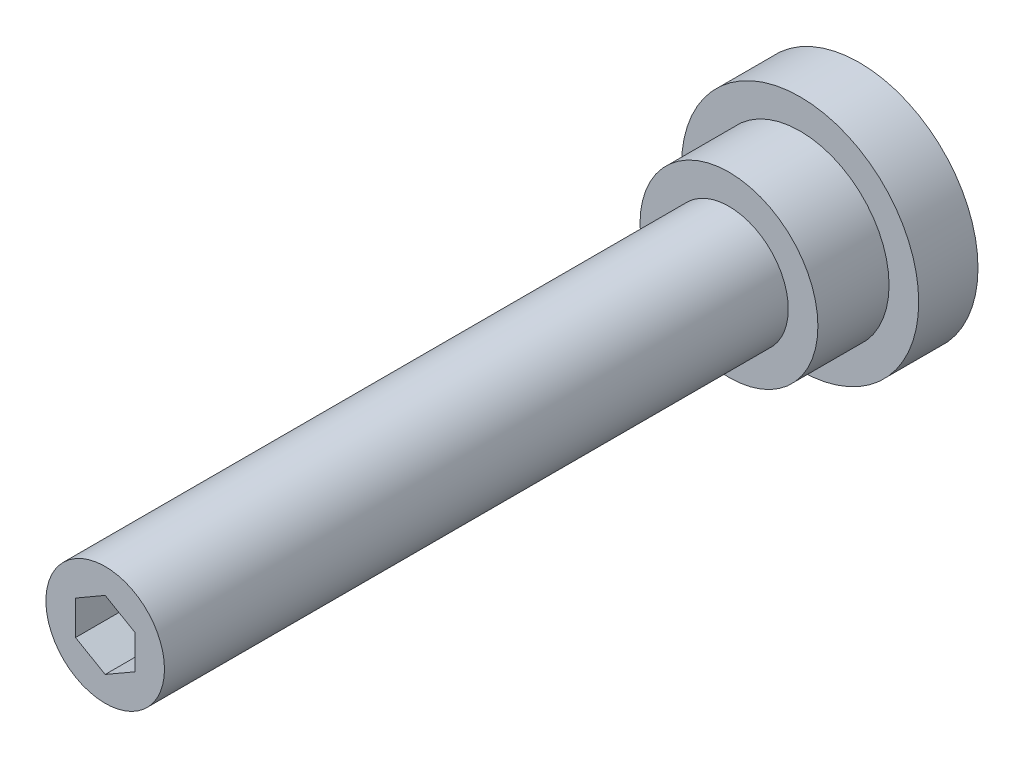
ISO-10303-21;
HEADER;
FILE_DESCRIPTION(('STEP AP214'),'2;1');
FILE_NAME('part.step','',(''),(''),'','','');
FILE_SCHEMA(('AUTOMOTIVE_DESIGN { 1 0 10303 214 1 1 1 1 }'));
ENDSEC;
DATA;
#1=APPLICATION_CONTEXT('core data for automotive mechanical design processes');
#2=APPLICATION_PROTOCOL_DEFINITION('international standard','automotive_design',2000,#1);
#3=PRODUCT_CONTEXT('',#1,'mechanical');
#4=PRODUCT('Part','Part','',(#3));
#5=PRODUCT_RELATED_PRODUCT_CATEGORY('part','',(#4));
#6=PRODUCT_DEFINITION_FORMATION('','',#4);
#7=PRODUCT_DEFINITION_CONTEXT('part definition',#1,'design');
#8=PRODUCT_DEFINITION('design','',#6,#7);
#9=PRODUCT_DEFINITION_SHAPE('','',#8);
#10=(LENGTH_UNIT() NAMED_UNIT(*) SI_UNIT(.MILLI.,.METRE.));
#11=(NAMED_UNIT(*) PLANE_ANGLE_UNIT() SI_UNIT($,.RADIAN.));
#12=(NAMED_UNIT(*) SI_UNIT($,.STERADIAN.) SOLID_ANGLE_UNIT());
#13=UNCERTAINTY_MEASURE_WITH_UNIT(LENGTH_MEASURE(1.E-05),#10,'distance_accuracy_value','');
#14=(GEOMETRIC_REPRESENTATION_CONTEXT(3) GLOBAL_UNCERTAINTY_ASSIGNED_CONTEXT((#13)) GLOBAL_UNIT_ASSIGNED_CONTEXT((#10,
#11,#12)) REPRESENTATION_CONTEXT('',''));
#15=CARTESIAN_POINT('',(0.,0.,0.));
#16=DIRECTION('',(0.,0.,1.));
#17=DIRECTION('',(1.,0.,0.));
#18=AXIS2_PLACEMENT_3D('',#15,#16,#17);
#19=CARTESIAN_POINT('',(0.,0.,63.6));
#20=DIRECTION('',(0.,0.,1.));
#21=DIRECTION('',(1.,0.,0.));
#22=AXIS2_PLACEMENT_3D('',#19,#20,#21);
#23=PLANE('',#22);
#24=DIRECTION('',(-0.866025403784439,0.5,0.));
#25=VECTOR('',#24,1.);
#26=CARTESIAN_POINT('',(2.5,1.44337567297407,63.6));
#27=LINE('',#26,#25);
#28=CARTESIAN_POINT('',(2.5,1.44337567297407,63.6));
#29=VERTEX_POINT('',#28);
#30=CARTESIAN_POINT('',(0.,2.88675134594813,63.6));
#31=VERTEX_POINT('',#30);
#32=EDGE_CURVE('E132',#29,#31,#27,.T.);
#33=ORIENTED_EDGE('',*,*,#32,.F.);
#34=DIRECTION('',(0.,1.,0.));
#35=VECTOR('',#34,1.);
#36=CARTESIAN_POINT('',(2.5,-1.44337567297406,63.6));
#37=LINE('',#36,#35);
#38=CARTESIAN_POINT('',(2.5,-1.44337567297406,63.6));
#39=VERTEX_POINT('',#38);
#40=EDGE_CURVE('E81',#39,#29,#37,.T.);
#41=ORIENTED_EDGE('',*,*,#40,.F.);
#42=DIRECTION('',(0.866025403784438,0.5,0.));
#43=VECTOR('',#42,1.);
#44=CARTESIAN_POINT('',(0.,-2.88675134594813,63.6));
#45=LINE('',#44,#43);
#46=CARTESIAN_POINT('',(0.,-2.88675134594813,63.6));
#47=VERTEX_POINT('',#46);
#48=EDGE_CURVE('E148',#47,#39,#45,.T.);
#49=ORIENTED_EDGE('',*,*,#48,.F.);
#50=DIRECTION('',(0.866025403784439,-0.5,0.));
#51=VECTOR('',#50,1.);
#52=CARTESIAN_POINT('',(-2.5,-1.44337567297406,63.6));
#53=LINE('',#52,#51);
#54=CARTESIAN_POINT('',(-2.5,-1.44337567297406,63.6));
#55=VERTEX_POINT('',#54);
#56=EDGE_CURVE('E146',#55,#47,#53,.T.);
#57=ORIENTED_EDGE('',*,*,#56,.F.);
#58=DIRECTION('',(0.,-1.,0.));
#59=VECTOR('',#58,1.);
#60=CARTESIAN_POINT('',(-2.5,1.44337567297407,63.6));
#61=LINE('',#60,#59);
#62=CARTESIAN_POINT('',(-2.5,1.44337567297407,63.6));
#63=VERTEX_POINT('',#62);
#64=EDGE_CURVE('E138',#63,#55,#61,.T.);
#65=ORIENTED_EDGE('',*,*,#64,.F.);
#66=DIRECTION('',(-0.866025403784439,-0.5,0.));
#67=VECTOR('',#66,1.);
#68=CARTESIAN_POINT('',(0.,2.88675134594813,63.6));
#69=LINE('',#68,#67);
#70=EDGE_CURVE('E136',#31,#63,#69,.T.);
#71=ORIENTED_EDGE('',*,*,#70,.F.);
#72=EDGE_LOOP('',(#33,#41,#49,#57,#65,#71));
#73=FACE_BOUND('',#72,.T.);
#74=CARTESIAN_POINT('',(0.,0.,63.6));
#75=DIRECTION('',(0.,0.,1.));
#76=DIRECTION('',(1.,0.,0.));
#77=AXIS2_PLACEMENT_3D('',#74,#75,#76);
#78=CIRCLE('',#77,5.);
#79=CARTESIAN_POINT('',(5.,0.,63.6));
#80=VERTEX_POINT('',#79);
#81=EDGE_CURVE('E9',#80,#80,#78,.T.);
#82=ORIENTED_EDGE('',*,*,#81,.T.);
#83=EDGE_LOOP('',(#82));
#84=FACE_BOUND('',#83,.T.);
#85=ADVANCED_FACE('F14',(#73,#84),#23,.T.);
#86=CARTESIAN_POINT('',(0.,0.,30.));
#87=DIRECTION('',(0.,0.,1.));
#88=DIRECTION('',(1.,0.,0.));
#89=AXIS2_PLACEMENT_3D('',#86,#87,#88);
#90=CYLINDRICAL_SURFACE('',#89,5.);
#91=CARTESIAN_POINT('',(0.,0.,11.));
#92=DIRECTION('',(0.,0.,1.));
#93=DIRECTION('',(1.,0.,0.));
#94=AXIS2_PLACEMENT_3D('',#91,#92,#93);
#95=CIRCLE('',#94,5.);
#96=CARTESIAN_POINT('',(5.,0.,11.));
#97=VERTEX_POINT('',#96);
#98=EDGE_CURVE('E21',#97,#97,#95,.T.);
#99=ORIENTED_EDGE('',*,*,#98,.T.);
#100=EDGE_LOOP('',(#99));
#101=FACE_BOUND('',#100,.T.);
#102=ORIENTED_EDGE('',*,*,#81,.F.);
#103=EDGE_LOOP('',(#102));
#104=FACE_BOUND('',#103,.T.);
#105=ADVANCED_FACE('F110',(#101,#104),#90,.T.);
#106=CARTESIAN_POINT('',(-5.,0.,11.));
#107=DIRECTION('',(0.,0.,1.));
#108=DIRECTION('',(1.,0.,0.));
#109=AXIS2_PLACEMENT_3D('',#106,#107,#108);
#110=PLANE('',#109);
#111=CARTESIAN_POINT('',(0.,0.,11.));
#112=DIRECTION('',(0.,0.,1.));
#113=DIRECTION('',(1.,0.,0.));
#114=AXIS2_PLACEMENT_3D('',#111,#112,#113);
#115=CIRCLE('',#114,7.5);
#116=CARTESIAN_POINT('',(7.5,0.,11.));
#117=VERTEX_POINT('',#116);
#118=EDGE_CURVE('E105',#117,#117,#115,.T.);
#119=ORIENTED_EDGE('',*,*,#118,.T.);
#120=EDGE_LOOP('',(#119));
#121=FACE_BOUND('',#120,.T.);
#122=ORIENTED_EDGE('',*,*,#98,.F.);
#123=EDGE_LOOP('',(#122));
#124=FACE_BOUND('',#123,.T.);
#125=ADVANCED_FACE('F113',(#121,#124),#110,.T.);
#126=CARTESIAN_POINT('',(0.,0.,30.));
#127=DIRECTION('',(0.,0.,1.));
#128=DIRECTION('',(1.,0.,0.));
#129=AXIS2_PLACEMENT_3D('',#126,#127,#128);
#130=CYLINDRICAL_SURFACE('',#129,7.5);
#131=CARTESIAN_POINT('',(0.,0.,5.));
#132=DIRECTION('',(0.,0.,1.));
#133=DIRECTION('',(1.,0.,0.));
#134=AXIS2_PLACEMENT_3D('',#131,#132,#133);
#135=CIRCLE('',#134,7.5);
#136=CARTESIAN_POINT('',(7.5,0.,5.));
#137=VERTEX_POINT('',#136);
#138=EDGE_CURVE('E102',#137,#137,#135,.T.);
#139=ORIENTED_EDGE('',*,*,#138,.T.);
#140=EDGE_LOOP('',(#139));
#141=FACE_BOUND('',#140,.T.);
#142=ORIENTED_EDGE('',*,*,#118,.F.);
#143=EDGE_LOOP('',(#142));
#144=FACE_BOUND('',#143,.T.);
#145=ADVANCED_FACE('F115',(#141,#144),#130,.T.);
#146=CARTESIAN_POINT('',(-7.5,0.,5.));
#147=DIRECTION('',(0.,0.,1.));
#148=DIRECTION('',(1.,0.,0.));
#149=AXIS2_PLACEMENT_3D('',#146,#147,#148);
#150=PLANE('',#149);
#151=CARTESIAN_POINT('',(0.,0.,5.));
#152=DIRECTION('',(0.,0.,1.));
#153=DIRECTION('',(1.,0.,0.));
#154=AXIS2_PLACEMENT_3D('',#151,#152,#153);
#155=CIRCLE('',#154,10.);
#156=CARTESIAN_POINT('',(10.,0.,5.));
#157=VERTEX_POINT('',#156);
#158=EDGE_CURVE('E87',#157,#157,#155,.T.);
#159=ORIENTED_EDGE('',*,*,#158,.T.);
#160=EDGE_LOOP('',(#159));
#161=FACE_BOUND('',#160,.T.);
#162=ORIENTED_EDGE('',*,*,#138,.F.);
#163=EDGE_LOOP('',(#162));
#164=FACE_BOUND('',#163,.T.);
#165=ADVANCED_FACE('F123',(#161,#164),#150,.T.);
#166=CARTESIAN_POINT('',(0.,0.,30.));
#167=DIRECTION('',(0.,0.,1.));
#168=DIRECTION('',(1.,0.,0.));
#169=AXIS2_PLACEMENT_3D('',#166,#167,#168);
#170=CYLINDRICAL_SURFACE('',#169,10.);
#171=CARTESIAN_POINT('',(0.,0.,0.));
#172=DIRECTION('',(0.,0.,1.));
#173=DIRECTION('',(1.,0.,0.));
#174=AXIS2_PLACEMENT_3D('',#171,#172,#173);
#175=CIRCLE('',#174,10.);
#176=CARTESIAN_POINT('',(10.,0.,0.));
#177=VERTEX_POINT('',#176);
#178=EDGE_CURVE('E83',#177,#177,#175,.T.);
#179=ORIENTED_EDGE('',*,*,#178,.T.);
#180=EDGE_LOOP('',(#179));
#181=FACE_BOUND('',#180,.T.);
#182=ORIENTED_EDGE('',*,*,#158,.F.);
#183=EDGE_LOOP('',(#182));
#184=FACE_BOUND('',#183,.T.);
#185=ADVANCED_FACE('F179',(#181,#184),#170,.T.);
#186=CARTESIAN_POINT('',(-10.,0.,0.));
#187=DIRECTION('',(0.,0.,-1.));
#188=DIRECTION('',(-1.,0.,0.));
#189=AXIS2_PLACEMENT_3D('',#186,#187,#188);
#190=PLANE('',#189);
#191=ORIENTED_EDGE('',*,*,#178,.F.);
#192=EDGE_LOOP('',(#191));
#193=FACE_BOUND('',#192,.T.);
#194=ADVANCED_FACE('F176',(#193),#190,.T.);
#195=CARTESIAN_POINT('',(2.5,1.44337567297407,58.6));
#196=DIRECTION('',(0.5,0.866025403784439,0.));
#197=DIRECTION('',(-0.866025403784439,0.5,0.));
#198=AXIS2_PLACEMENT_3D('',#195,#196,#197);
#199=PLANE('',#198);
#200=DIRECTION('',(0.,0.,1.));
#201=VECTOR('',#200,1.);
#202=CARTESIAN_POINT('',(0.,2.88675134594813,58.6));
#203=LINE('',#202,#201);
#204=CARTESIAN_POINT('',(0.,2.88675134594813,59.6));
#205=VERTEX_POINT('',#204);
#206=EDGE_CURVE('E35',#205,#31,#203,.T.);
#207=ORIENTED_EDGE('',*,*,#206,.F.);
#208=DIRECTION('',(-0.866025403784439,0.5,0.));
#209=VECTOR('',#208,1.);
#210=CARTESIAN_POINT('',(2.5,1.44337567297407,59.6));
#211=LINE('',#210,#209);
#212=CARTESIAN_POINT('',(2.5,1.44337567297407,59.6));
#213=VERTEX_POINT('',#212);
#214=EDGE_CURVE('E28',#213,#205,#211,.T.);
#215=ORIENTED_EDGE('',*,*,#214,.F.);
#216=DIRECTION('',(0.,0.,1.));
#217=VECTOR('',#216,1.);
#218=CARTESIAN_POINT('',(2.5,1.44337567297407,58.6));
#219=LINE('',#218,#217);
#220=EDGE_CURVE('E75',#213,#29,#219,.T.);
#221=ORIENTED_EDGE('',*,*,#220,.T.);
#222=ORIENTED_EDGE('',*,*,#32,.T.);
#223=EDGE_LOOP('',(#207,#215,#221,#222));
#224=FACE_BOUND('',#223,.T.);
#225=ADVANCED_FACE('F74',(#224),#199,.F.);
#226=CARTESIAN_POINT('',(2.5,-1.44337567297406,58.6));
#227=DIRECTION('',(1.,0.,0.));
#228=DIRECTION('',(0.,0.,-1.));
#229=AXIS2_PLACEMENT_3D('',#226,#227,#228);
#230=PLANE('',#229);
#231=ORIENTED_EDGE('',*,*,#220,.F.);
#232=DIRECTION('',(0.,1.,0.));
#233=VECTOR('',#232,1.);
#234=CARTESIAN_POINT('',(2.5,-1.44337567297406,59.6));
#235=LINE('',#234,#233);
#236=CARTESIAN_POINT('',(2.5,-1.44337567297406,59.6));
#237=VERTEX_POINT('',#236);
#238=EDGE_CURVE('E65',#237,#213,#235,.T.);
#239=ORIENTED_EDGE('',*,*,#238,.F.);
#240=DIRECTION('',(0.,0.,1.));
#241=VECTOR('',#240,1.);
#242=CARTESIAN_POINT('',(2.5,-1.44337567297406,58.6));
#243=LINE('',#242,#241);
#244=EDGE_CURVE('E84',#237,#39,#243,.T.);
#245=ORIENTED_EDGE('',*,*,#244,.T.);
#246=ORIENTED_EDGE('',*,*,#40,.T.);
#247=EDGE_LOOP('',(#231,#239,#245,#246));
#248=FACE_BOUND('',#247,.T.);
#249=ADVANCED_FACE('F79',(#248),#230,.F.);
#250=CARTESIAN_POINT('',(0.,-2.88675134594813,58.6));
#251=DIRECTION('',(0.5,-0.866025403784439,0.));
#252=DIRECTION('',(0.866025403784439,0.5,0.));
#253=AXIS2_PLACEMENT_3D('',#250,#251,#252);
#254=PLANE('',#253);
#255=ORIENTED_EDGE('',*,*,#244,.F.);
#256=DIRECTION('',(0.866025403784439,0.5,0.));
#257=VECTOR('',#256,1.);
#258=CARTESIAN_POINT('',(0.,-2.88675134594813,59.6));
#259=LINE('',#258,#257);
#260=CARTESIAN_POINT('',(0.,-2.88675134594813,59.6));
#261=VERTEX_POINT('',#260);
#262=EDGE_CURVE('E68',#261,#237,#259,.T.);
#263=ORIENTED_EDGE('',*,*,#262,.F.);
#264=DIRECTION('',(0.,0.,1.));
#265=VECTOR('',#264,1.);
#266=CARTESIAN_POINT('',(0.,-2.88675134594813,58.6));
#267=LINE('',#266,#265);
#268=EDGE_CURVE('E89',#261,#47,#267,.T.);
#269=ORIENTED_EDGE('',*,*,#268,.T.);
#270=ORIENTED_EDGE('',*,*,#48,.T.);
#271=EDGE_LOOP('',(#255,#263,#269,#270));
#272=FACE_BOUND('',#271,.T.);
#273=ADVANCED_FACE('F151',(#272),#254,.F.);
#274=CARTESIAN_POINT('',(-2.5,-1.44337567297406,58.6));
#275=DIRECTION('',(-0.5,-0.866025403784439,0.));
#276=DIRECTION('',(0.866025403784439,-0.5,0.));
#277=AXIS2_PLACEMENT_3D('',#274,#275,#276);
#278=PLANE('',#277);
#279=ORIENTED_EDGE('',*,*,#268,.F.);
#280=DIRECTION('',(0.866025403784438,-0.5,0.));
#281=VECTOR('',#280,1.);
#282=CARTESIAN_POINT('',(-2.5,-1.44337567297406,59.6));
#283=LINE('',#282,#281);
#284=CARTESIAN_POINT('',(-2.5,-1.44337567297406,59.6));
#285=VERTEX_POINT('',#284);
#286=EDGE_CURVE('E140',#285,#261,#283,.T.);
#287=ORIENTED_EDGE('',*,*,#286,.F.);
#288=DIRECTION('',(0.,0.,1.));
#289=VECTOR('',#288,1.);
#290=CARTESIAN_POINT('',(-2.5,-1.44337567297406,58.6));
#291=LINE('',#290,#289);
#292=EDGE_CURVE('E95',#285,#55,#291,.T.);
#293=ORIENTED_EDGE('',*,*,#292,.T.);
#294=ORIENTED_EDGE('',*,*,#56,.T.);
#295=EDGE_LOOP('',(#279,#287,#293,#294));
#296=FACE_BOUND('',#295,.T.);
#297=ADVANCED_FACE('F155',(#296),#278,.F.);
#298=CARTESIAN_POINT('',(-2.5,1.44337567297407,58.6));
#299=DIRECTION('',(-1.,0.,0.));
#300=DIRECTION('',(0.,-1.,0.));
#301=AXIS2_PLACEMENT_3D('',#298,#299,#300);
#302=PLANE('',#301);
#303=ORIENTED_EDGE('',*,*,#292,.F.);
#304=DIRECTION('',(0.,-1.,0.));
#305=VECTOR('',#304,1.);
#306=CARTESIAN_POINT('',(-2.5,1.44337567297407,59.6));
#307=LINE('',#306,#305);
#308=CARTESIAN_POINT('',(-2.5,1.44337567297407,59.6));
#309=VERTEX_POINT('',#308);
#310=EDGE_CURVE('E162',#309,#285,#307,.T.);
#311=ORIENTED_EDGE('',*,*,#310,.F.);
#312=DIRECTION('',(0.,0.,1.));
#313=VECTOR('',#312,1.);
#314=CARTESIAN_POINT('',(-2.5,1.44337567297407,58.6));
#315=LINE('',#314,#313);
#316=EDGE_CURVE('E97',#309,#63,#315,.T.);
#317=ORIENTED_EDGE('',*,*,#316,.T.);
#318=ORIENTED_EDGE('',*,*,#64,.T.);
#319=EDGE_LOOP('',(#303,#311,#317,#318));
#320=FACE_BOUND('',#319,.T.);
#321=ADVANCED_FACE('F160',(#320),#302,.F.);
#322=CARTESIAN_POINT('',(0.,2.88675134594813,58.6));
#323=DIRECTION('',(-0.5,0.866025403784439,0.));
#324=DIRECTION('',(-0.866025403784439,-0.5,0.));
#325=AXIS2_PLACEMENT_3D('',#322,#323,#324);
#326=PLANE('',#325);
#327=ORIENTED_EDGE('',*,*,#316,.F.);
#328=DIRECTION('',(-0.866025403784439,-0.5,0.));
#329=VECTOR('',#328,1.);
#330=CARTESIAN_POINT('',(0.,2.88675134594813,59.6));
#331=LINE('',#330,#329);
#332=EDGE_CURVE('E77',#205,#309,#331,.T.);
#333=ORIENTED_EDGE('',*,*,#332,.F.);
#334=ORIENTED_EDGE('',*,*,#206,.T.);
#335=ORIENTED_EDGE('',*,*,#70,.T.);
#336=EDGE_LOOP('',(#327,#333,#334,#335));
#337=FACE_BOUND('',#336,.T.);
#338=ADVANCED_FACE('F163',(#337),#326,.F.);
#339=CARTESIAN_POINT('',(2.5,1.44337567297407,59.6));
#340=DIRECTION('',(0.,0.,1.));
#341=DIRECTION('',(1.,0.,0.));
#342=AXIS2_PLACEMENT_3D('',#339,#340,#341);
#343=PLANE('',#342);
#344=ORIENTED_EDGE('',*,*,#238,.T.);
#345=ORIENTED_EDGE('',*,*,#214,.T.);
#346=ORIENTED_EDGE('',*,*,#332,.T.);
#347=ORIENTED_EDGE('',*,*,#310,.T.);
#348=ORIENTED_EDGE('',*,*,#286,.T.);
#349=ORIENTED_EDGE('',*,*,#262,.T.);
#350=EDGE_LOOP('',(#344,#345,#346,#347,#348,#349));
#351=FACE_BOUND('',#350,.T.);
#352=ADVANCED_FACE('F66',(#351),#343,.T.);
#353=CLOSED_SHELL('',(#85,#105,#125,#145,#165,#185,#194,#225,#249,#273,#297,#321,#338,#352));
#354=MANIFOLD_SOLID_BREP('B1',#353);
#355=ADVANCED_BREP_SHAPE_REPRESENTATION('',(#18,#354),#14);
#356=SHAPE_DEFINITION_REPRESENTATION(#9,#355);
ENDSEC;
END-ISO-10303-21;
